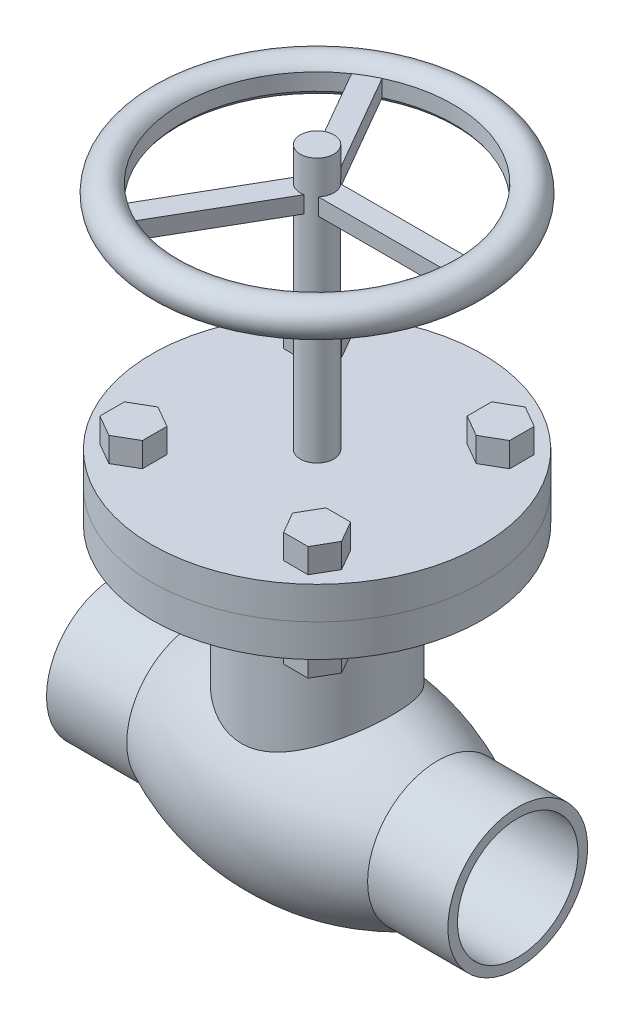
from build123d import *

# Parameters (mm, degrees)
BODY_EXTRUDE_SKETCH_R            = 40.61079
BODY_EXTRUDE_DEPTH               = 115.189
FLANGE_BOTTOM_SKETCH_R           = 88.9
FLANGE_BOTTOM_DEPTH              = 17.526
FLANGE_TOP_SKETCH_R              = 88.9
FLANGE_TOP_DEPTH                 = 17.526
CENTRE_SUPPORT_REACH             = 357.862
CENTRE_SUPPORT_SKETCH_R          = 9.017
CENTRE_SUPPORT_DIRECTION_2_DEPTH = 18.034
DRIVER_START                     = -9.017
DRIVER_CUT_DEPTH                 = 9.017
ID_SKETCH_R                      = 32.4358
ID_CUT_DEPTH                     = 375.402424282
BOLT_DEPTH                       = 61.341
BOLT_PATTERN_COUNT               = 4
BOLT_PATTERN_ANGLE               = 270


with BuildPart() as part:
    # Flow Extrude Sketch → Flow Extrude (revolve)
    with BuildSketch(Plane.XY, mode=Mode.PRIVATE) as flow_extrude_sk:
        with BuildLine():
            Line((64.77, 37.592), (107.95, 37.592))
            Line((107.95, 37.592), (107.95, 0))
            Line((107.95, 0), (-107.95, 0))
            Line((-107.95, 0), (-107.95, 37.592))
            Line((-107.95, 37.592), (-64.77, 37.592))
            ThreePointArc((-64.77, 37.592), (0, 52.6288), (64.77, 37.592))
        make_face()
    revolve(flow_extrude_sk.sketch.rotate(Axis((-109.682317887, 0, 0), (1, 0, 0)), 90), axis=Axis((-109.682317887, 0, 0), (1, 0, 0)))

    # Body Extrude Sketch → Body Extrude (add)
    with BuildSketch(Plane(origin=(0, 0, 0), x_dir=(1, 0, 0), z_dir=(0, 1, 0))):
        with Locations(Location((0, 0, 0), (0, 0, 116.198829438))):
            Circle(BODY_EXTRUDE_SKETCH_R)
    extrude(amount=BODY_EXTRUDE_DEPTH)

    # Flange Bottom Sketch → Flange Bottom (add)
    with BuildSketch(Plane(origin=(0, 115.189, 0), x_dir=(-1, 0, 0), z_dir=(0, 1, 0))):
        with Locations(Location((0, 0, 0), (0, 0, 90))):
            Circle(FLANGE_BOTTOM_SKETCH_R)
    extrude(amount=FLANGE_BOTTOM_DEPTH)

    # Flange Top Sketch → Flange Top (add)
    with BuildSketch(Plane(origin=(0, 132.715, 0), x_dir=(-1, 0, 0), z_dir=(0, 1, 0))):
        with Locations(Location((0, 0, 0), (0, 0, 90))):
            Circle(FLANGE_TOP_SKETCH_R)
    extrude(amount=FLANGE_TOP_DEPTH)

    # Centre Support: up to this face of the body (flat: up to its plane)
    centre_support_end = Plane(part.part.faces().sort_by_distance((0, 150.241, 0))[0])
    # Centre Support Sketch → Centre Support (add, up to the picked face)
    with BuildSketch(Plane(origin=(0, 274.2565, 0), x_dir=(-1, 0, 0), z_dir=(0, 1, 0)), mode=Mode.PRIVATE) as centre_support_sk1:
        with Locations(Location((0, 0, 0), (0, 0, 90))):
            Circle(CENTRE_SUPPORT_SKETCH_R)
    centre_support_tool1 = split(extrude(centre_support_sk1.sketch, amount=-CENTRE_SUPPORT_REACH, mode=Mode.PRIVATE), bisect_by=centre_support_end, keep=Keep.BOTH, mode=Mode.PRIVATE)


with BuildPart() as body_2:
    # Driver Sweep: sweep along a path in Driver Path
    with BuildLine(Plane(origin=(0, 269.748, 0), x_dir=(-1, 0, 0), z_dir=(0, 1, 0))) as driver_sweep_path:
        CenterArc((0, 0), 90.17, 0, 360)
    # Driver Profile → Driver Sweep (sweep)
    with BuildSketch(Plane.XY):
        with BuildLine():
            Line((-73.344048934, 274.2565), (0, 274.2565))
            Line((0, 274.2565), (0, 265.2395))
            Line((0, 265.2395), (-73.344048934, 265.2395))
            ThreePointArc((-73.344048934, 265.2395), (-90.17, 269.748), (-73.344048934, 274.2565))
        make_face()
    sweep(path=driver_sweep_path.line)


with BuildPart() as part_1:
    add(part.part)

    add(body_2.part)  # Centre Support merges body 2
    add(centre_support_tool1.solids().sort_by(Axis((0, 274.2565, 0), (0, -1, 0)))[0])

    # Centre Support Sketch → Centre Support direction 2 (add)
    with BuildSketch(Plane(origin=(0, 274.2565, 0), x_dir=(-1, 0, 0), z_dir=(0, 1, 0))):
        with Locations(Location((0, 0, 0), (0, 0, 90))):
            Circle(CENTRE_SUPPORT_SKETCH_R)
    extrude(amount=CENTRE_SUPPORT_DIRECTION_2_DEPTH)

    # Driver Cut Sketch → Driver Cut (cut)
    with BuildSketch(Plane(origin=(0, 274.2565, 0), x_dir=(-1, 0, 0), z_dir=(0, 1, 0)).offset(DRIVER_START)):
        with BuildLine():
            Line((31.342676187, 66.309774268), (-1.845529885, 8.826115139))
            ThreePointArc((-1.845529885, 8.826115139), (-4.5085, 7.808951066), (-6.720874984, 6.011333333))
            Line((-6.720874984, 6.011333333), (-73.097287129, 6.011333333))
            ThreePointArc((-73.097287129, 6.011333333), (-36.672024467, 63.517809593), (31.342676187, 66.309774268))
        make_face()
        with BuildLine():
            Line((-73.097287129, -6.011333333), (-6.720874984, -6.011333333))
            ThreePointArc((-6.720874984, -6.011333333), (-4.5085, -7.808951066), (-1.845529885, -8.826115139))
            Line((-1.845529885, -8.826115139), (31.342676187, -66.309774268))
            ThreePointArc((31.342676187, -66.309774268), (-36.672024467, -63.517809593), (-73.097287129, -6.011333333))
        make_face()
        with BuildLine():
            Line((41.754610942, 60.298440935), (8.566404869, 2.814781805))
            ThreePointArc((8.566404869, 2.814781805), (9.017, 0), (8.566404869, -2.814781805))
            Line((8.566404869, -2.814781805), (41.754610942, -60.298440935))
            ThreePointArc((41.754610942, -60.298440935), (73.344048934, 0), (41.754610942, 60.298440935))
        make_face()
    extrude(amount=DRIVER_CUT_DEPTH, mode=Mode.SUBTRACT)

    # ID Sketch → ID Cut (cut, through all)
    with BuildSketch(Plane.ZY.offset(-107.95)):
        Circle(ID_SKETCH_R)
    extrude(amount=ID_CUT_DEPTH, mode=Mode.SUBTRACT)

    # Bolt Sketch → Bolt (add)
    with BuildSketch(Plane(origin=(0, 163.3855, 0), x_dir=(-1, 0, 0), z_dir=(0, 1, 0))):
        Polygon((-49.391408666, -36.193181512), (-60.821408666, -42.792295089), (-60.821408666, -55.990522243), (-49.391408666, -62.58963582), (-37.961408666, -55.990522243), (-37.961408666, -42.792295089), align=None)
    bolt = extrude(amount=-BOLT_DEPTH)

    # Bolt Pattern: Bolt ×4 about axis
    bolt_pattern_axis = Axis((0, 132.715, 0), (0, -1, 0))
    for i in range(1, BOLT_PATTERN_COUNT):
        add(bolt.rotate(bolt_pattern_axis, i * BOLT_PATTERN_ANGLE / (BOLT_PATTERN_COUNT - 1)))


solid = part_1.part
